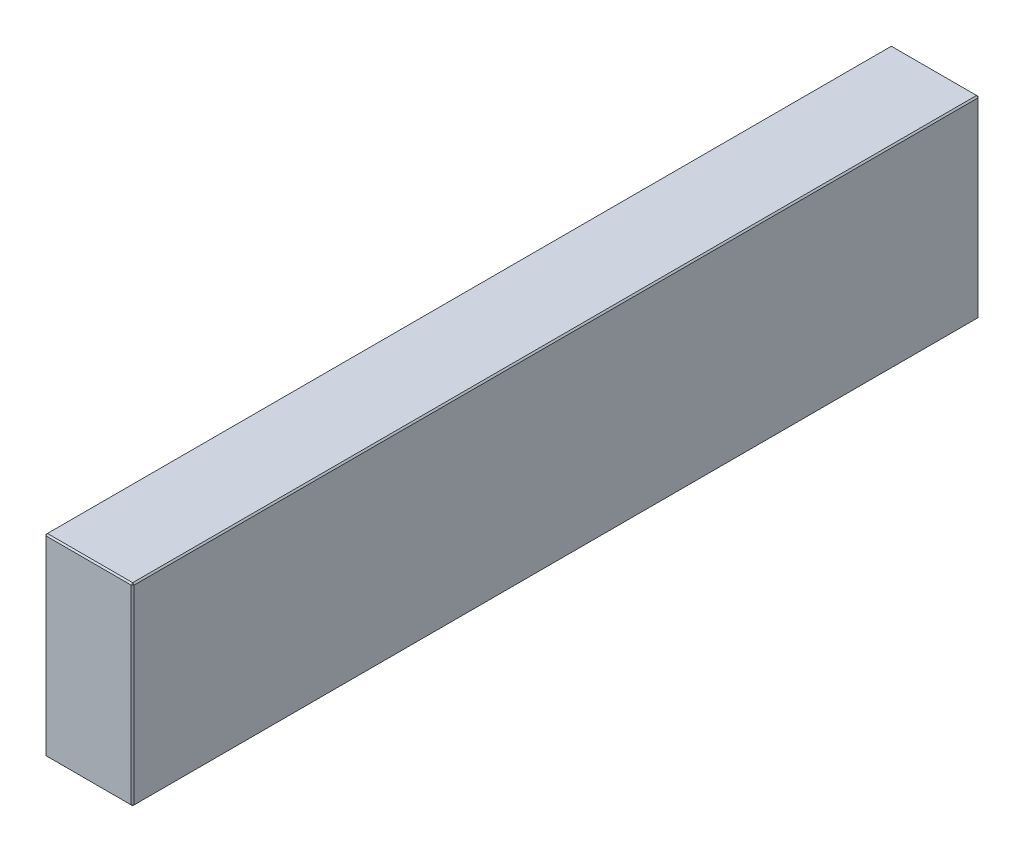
ISO-10303-21;
HEADER;
FILE_DESCRIPTION(('STEP AP214'),'2;1');
FILE_NAME('part.step','',(''),(''),'','','');
FILE_SCHEMA(('AUTOMOTIVE_DESIGN { 1 0 10303 214 1 1 1 1 }'));
ENDSEC;
DATA;
#1=APPLICATION_CONTEXT('core data for automotive mechanical design processes');
#2=APPLICATION_PROTOCOL_DEFINITION('international standard','automotive_design',2000,#1);
#3=PRODUCT_CONTEXT('',#1,'mechanical');
#4=PRODUCT('Part','Part','',(#3));
#5=PRODUCT_RELATED_PRODUCT_CATEGORY('part','',(#4));
#6=PRODUCT_DEFINITION_FORMATION('','',#4);
#7=PRODUCT_DEFINITION_CONTEXT('part definition',#1,'design');
#8=PRODUCT_DEFINITION('design','',#6,#7);
#9=PRODUCT_DEFINITION_SHAPE('','',#8);
#10=(LENGTH_UNIT() NAMED_UNIT(*) SI_UNIT(.MILLI.,.METRE.));
#11=(NAMED_UNIT(*) PLANE_ANGLE_UNIT() SI_UNIT($,.RADIAN.));
#12=(NAMED_UNIT(*) SI_UNIT($,.STERADIAN.) SOLID_ANGLE_UNIT());
#13=UNCERTAINTY_MEASURE_WITH_UNIT(LENGTH_MEASURE(1.E-05),#10,'distance_accuracy_value','');
#14=(GEOMETRIC_REPRESENTATION_CONTEXT(3) GLOBAL_UNCERTAINTY_ASSIGNED_CONTEXT((#13)) GLOBAL_UNIT_ASSIGNED_CONTEXT((#10,
#11,#12)) REPRESENTATION_CONTEXT('',''));
#15=CARTESIAN_POINT('',(0.,0.,0.));
#16=DIRECTION('',(0.,0.,1.));
#17=DIRECTION('',(1.,0.,0.));
#18=AXIS2_PLACEMENT_3D('',#15,#16,#17);
#19=CARTESIAN_POINT('',(-31.,136.,298.));
#20=DIRECTION('',(1.,0.,0.));
#21=DIRECTION('',(0.,0.,-1.));
#22=AXIS2_PLACEMENT_3D('',#19,#20,#21);
#23=PLANE('',#22);
#24=DIRECTION('',(0.,-1.,0.));
#25=VECTOR('',#24,1.);
#26=CARTESIAN_POINT('',(-31.,136.,-297.));
#27=LINE('',#26,#25);
#28=CARTESIAN_POINT('',(-31.,135.,-297.));
#29=VERTEX_POINT('',#28);
#30=CARTESIAN_POINT('',(-31.,0.999999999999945,-297.));
#31=VERTEX_POINT('',#30);
#32=EDGE_CURVE('E114',#29,#31,#27,.T.);
#33=ORIENTED_EDGE('',*,*,#32,.T.);
#34=DIRECTION('',(0.,0.,1.));
#35=VECTOR('',#34,1.);
#36=CARTESIAN_POINT('',(-31.,0.999999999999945,298.));
#37=LINE('',#36,#35);
#38=CARTESIAN_POINT('',(-31.,0.999999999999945,297.));
#39=VERTEX_POINT('',#38);
#40=EDGE_CURVE('E110',#31,#39,#37,.T.);
#41=ORIENTED_EDGE('',*,*,#40,.T.);
#42=DIRECTION('',(0.,1.,0.));
#43=VECTOR('',#42,1.);
#44=CARTESIAN_POINT('',(-31.,136.,297.));
#45=LINE('',#44,#43);
#46=CARTESIAN_POINT('',(-31.,135.,297.));
#47=VERTEX_POINT('',#46);
#48=EDGE_CURVE('E103',#39,#47,#45,.T.);
#49=ORIENTED_EDGE('',*,*,#48,.T.);
#50=DIRECTION('',(0.,0.,-1.));
#51=VECTOR('',#50,1.);
#52=CARTESIAN_POINT('',(-31.,135.,-298.));
#53=LINE('',#52,#51);
#54=EDGE_CURVE('E107',#47,#29,#53,.T.);
#55=ORIENTED_EDGE('',*,*,#54,.T.);
#56=EDGE_LOOP('',(#33,#41,#49,#55));
#57=FACE_BOUND('',#56,.T.);
#58=ADVANCED_FACE('F15',(#57),#23,.F.);
#59=CARTESIAN_POINT('',(31.,136.,298.));
#60=DIRECTION('',(0.,0.,-1.));
#61=DIRECTION('',(-1.,0.,0.));
#62=AXIS2_PLACEMENT_3D('',#59,#60,#61);
#63=PLANE('',#62);
#64=DIRECTION('',(-1.,0.,0.));
#65=VECTOR('',#64,1.);
#66=CARTESIAN_POINT('',(-31.,135.,298.));
#67=LINE('',#66,#65);
#68=CARTESIAN_POINT('',(30.,135.,298.));
#69=VERTEX_POINT('',#68);
#70=CARTESIAN_POINT('',(-30.,135.,298.));
#71=VERTEX_POINT('',#70);
#72=EDGE_CURVE('E164',#69,#71,#67,.T.);
#73=ORIENTED_EDGE('',*,*,#72,.T.);
#74=DIRECTION('',(0.,-1.,0.));
#75=VECTOR('',#74,1.);
#76=CARTESIAN_POINT('',(-30.,136.,298.));
#77=LINE('',#76,#75);
#78=CARTESIAN_POINT('',(-30.,0.999999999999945,298.));
#79=VERTEX_POINT('',#78);
#80=EDGE_CURVE('E122',#71,#79,#77,.T.);
#81=ORIENTED_EDGE('',*,*,#80,.T.);
#82=DIRECTION('',(1.,0.,0.));
#83=VECTOR('',#82,1.);
#84=CARTESIAN_POINT('',(31.,0.999999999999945,298.));
#85=LINE('',#84,#83);
#86=CARTESIAN_POINT('',(30.,0.999999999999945,298.));
#87=VERTEX_POINT('',#86);
#88=EDGE_CURVE('E168',#79,#87,#85,.T.);
#89=ORIENTED_EDGE('',*,*,#88,.T.);
#90=DIRECTION('',(0.,1.,0.));
#91=VECTOR('',#90,1.);
#92=CARTESIAN_POINT('',(30.,136.,298.));
#93=LINE('',#92,#91);
#94=EDGE_CURVE('E166',#87,#69,#93,.T.);
#95=ORIENTED_EDGE('',*,*,#94,.T.);
#96=EDGE_LOOP('',(#73,#81,#89,#95));
#97=FACE_BOUND('',#96,.T.);
#98=ADVANCED_FACE('F275',(#97),#63,.F.);
#99=CARTESIAN_POINT('',(31.,136.,298.));
#100=DIRECTION('',(-1.,0.,0.));
#101=DIRECTION('',(0.,0.,1.));
#102=AXIS2_PLACEMENT_3D('',#99,#100,#101);
#103=PLANE('',#102);
#104=DIRECTION('',(0.,0.,-1.));
#105=VECTOR('',#104,1.);
#106=CARTESIAN_POINT('',(31.,0.999999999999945,298.));
#107=LINE('',#106,#105);
#108=CARTESIAN_POINT('',(31.,0.999999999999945,297.));
#109=VERTEX_POINT('',#108);
#110=CARTESIAN_POINT('',(31.,0.999999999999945,-297.));
#111=VERTEX_POINT('',#110);
#112=EDGE_CURVE('E159',#109,#111,#107,.T.);
#113=ORIENTED_EDGE('',*,*,#112,.T.);
#114=DIRECTION('',(0.,1.,0.));
#115=VECTOR('',#114,1.);
#116=CARTESIAN_POINT('',(31.,136.,-297.));
#117=LINE('',#116,#115);
#118=CARTESIAN_POINT('',(31.,135.,-297.));
#119=VERTEX_POINT('',#118);
#120=EDGE_CURVE('E161',#111,#119,#117,.T.);
#121=ORIENTED_EDGE('',*,*,#120,.T.);
#122=DIRECTION('',(0.,0.,1.));
#123=VECTOR('',#122,1.);
#124=CARTESIAN_POINT('',(31.,135.,298.));
#125=LINE('',#124,#123);
#126=CARTESIAN_POINT('',(31.,135.,297.));
#127=VERTEX_POINT('',#126);
#128=EDGE_CURVE('E155',#119,#127,#125,.T.);
#129=ORIENTED_EDGE('',*,*,#128,.T.);
#130=DIRECTION('',(0.,-1.,0.));
#131=VECTOR('',#130,1.);
#132=CARTESIAN_POINT('',(31.,136.,297.));
#133=LINE('',#132,#131);
#134=EDGE_CURVE('E157',#127,#109,#133,.T.);
#135=ORIENTED_EDGE('',*,*,#134,.T.);
#136=EDGE_LOOP('',(#113,#121,#129,#135));
#137=FACE_BOUND('',#136,.T.);
#138=ADVANCED_FACE('F254',(#137),#103,.F.);
#139=CARTESIAN_POINT('',(31.,136.,-298.));
#140=DIRECTION('',(0.,0.,1.));
#141=DIRECTION('',(1.,0.,0.));
#142=AXIS2_PLACEMENT_3D('',#139,#140,#141);
#143=PLANE('',#142);
#144=DIRECTION('',(0.,-1.,0.));
#145=VECTOR('',#144,1.);
#146=CARTESIAN_POINT('',(30.,136.,-298.));
#147=LINE('',#146,#145);
#148=CARTESIAN_POINT('',(30.,135.,-298.));
#149=VERTEX_POINT('',#148);
#150=CARTESIAN_POINT('',(30.,0.999999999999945,-298.));
#151=VERTEX_POINT('',#150);
#152=EDGE_CURVE('E148',#149,#151,#147,.T.);
#153=ORIENTED_EDGE('',*,*,#152,.T.);
#154=DIRECTION('',(-1.,0.,0.));
#155=VECTOR('',#154,1.);
#156=CARTESIAN_POINT('',(31.,0.999999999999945,-298.));
#157=LINE('',#156,#155);
#158=CARTESIAN_POINT('',(-30.,0.999999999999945,-298.));
#159=VERTEX_POINT('',#158);
#160=EDGE_CURVE('E153',#151,#159,#157,.T.);
#161=ORIENTED_EDGE('',*,*,#160,.T.);
#162=DIRECTION('',(0.,1.,0.));
#163=VECTOR('',#162,1.);
#164=CARTESIAN_POINT('',(-30.,136.,-298.));
#165=LINE('',#164,#163);
#166=CARTESIAN_POINT('',(-30.,135.,-298.));
#167=VERTEX_POINT('',#166);
#168=EDGE_CURVE('E150',#159,#167,#165,.T.);
#169=ORIENTED_EDGE('',*,*,#168,.T.);
#170=DIRECTION('',(1.,0.,0.));
#171=VECTOR('',#170,1.);
#172=CARTESIAN_POINT('',(31.,135.,-298.));
#173=LINE('',#172,#171);
#174=EDGE_CURVE('E146',#167,#149,#173,.T.);
#175=ORIENTED_EDGE('',*,*,#174,.T.);
#176=EDGE_LOOP('',(#153,#161,#169,#175));
#177=FACE_BOUND('',#176,.T.);
#178=ADVANCED_FACE('F284',(#177),#143,.F.);
#179=CARTESIAN_POINT('',(0.,136.,0.));
#180=DIRECTION('',(0.,1.,0.));
#181=DIRECTION('',(0.,0.,1.));
#182=AXIS2_PLACEMENT_3D('',#179,#180,#181);
#183=PLANE('',#182);
#184=DIRECTION('',(0.,0.,-1.));
#185=VECTOR('',#184,1.);
#186=CARTESIAN_POINT('',(30.,136.,-298.));
#187=LINE('',#186,#185);
#188=CARTESIAN_POINT('',(30.,136.,297.));
#189=VERTEX_POINT('',#188);
#190=CARTESIAN_POINT('',(30.,136.,-297.));
#191=VERTEX_POINT('',#190);
#192=EDGE_CURVE('E24',#189,#191,#187,.T.);
#193=ORIENTED_EDGE('',*,*,#192,.T.);
#194=DIRECTION('',(-1.,0.,0.));
#195=VECTOR('',#194,1.);
#196=CARTESIAN_POINT('',(-31.,136.,-297.));
#197=LINE('',#196,#195);
#198=CARTESIAN_POINT('',(-30.,136.,-297.));
#199=VERTEX_POINT('',#198);
#200=EDGE_CURVE('E9',#191,#199,#197,.T.);
#201=ORIENTED_EDGE('',*,*,#200,.T.);
#202=DIRECTION('',(0.,0.,1.));
#203=VECTOR('',#202,1.);
#204=CARTESIAN_POINT('',(-30.,136.,298.));
#205=LINE('',#204,#203);
#206=CARTESIAN_POINT('',(-30.,136.,297.));
#207=VERTEX_POINT('',#206);
#208=EDGE_CURVE('E180',#199,#207,#205,.T.);
#209=ORIENTED_EDGE('',*,*,#208,.T.);
#210=DIRECTION('',(1.,0.,0.));
#211=VECTOR('',#210,1.);
#212=CARTESIAN_POINT('',(31.,136.,297.));
#213=LINE('',#212,#211);
#214=EDGE_CURVE('E35',#207,#189,#213,.T.);
#215=ORIENTED_EDGE('',*,*,#214,.T.);
#216=EDGE_LOOP('',(#193,#201,#209,#215));
#217=FACE_BOUND('',#216,.T.);
#218=ADVANCED_FACE('F350',(#217),#183,.T.);
#219=CARTESIAN_POINT('',(0.,0.,0.));
#220=DIRECTION('',(0.,1.,0.));
#221=DIRECTION('',(0.,0.,1.));
#222=AXIS2_PLACEMENT_3D('',#219,#220,#221);
#223=PLANE('',#222);
#224=DIRECTION('',(0.,0.,1.));
#225=VECTOR('',#224,1.);
#226=CARTESIAN_POINT('',(30.,0.,0.));
#227=LINE('',#226,#225);
#228=CARTESIAN_POINT('',(30.,0.,-297.));
#229=VERTEX_POINT('',#228);
#230=CARTESIAN_POINT('',(30.,0.,297.));
#231=VERTEX_POINT('',#230);
#232=EDGE_CURVE('E171',#229,#231,#227,.T.);
#233=ORIENTED_EDGE('',*,*,#232,.T.);
#234=DIRECTION('',(-1.,0.,0.));
#235=VECTOR('',#234,1.);
#236=CARTESIAN_POINT('',(0.,0.,297.));
#237=LINE('',#236,#235);
#238=CARTESIAN_POINT('',(-30.,0.,297.));
#239=VERTEX_POINT('',#238);
#240=EDGE_CURVE('E177',#231,#239,#237,.T.);
#241=ORIENTED_EDGE('',*,*,#240,.T.);
#242=DIRECTION('',(0.,0.,-1.));
#243=VECTOR('',#242,1.);
#244=CARTESIAN_POINT('',(-30.,0.,0.));
#245=LINE('',#244,#243);
#246=CARTESIAN_POINT('',(-30.,0.,-297.));
#247=VERTEX_POINT('',#246);
#248=EDGE_CURVE('E175',#239,#247,#245,.T.);
#249=ORIENTED_EDGE('',*,*,#248,.T.);
#250=DIRECTION('',(1.,0.,0.));
#251=VECTOR('',#250,1.);
#252=CARTESIAN_POINT('',(0.,0.,-297.));
#253=LINE('',#252,#251);
#254=EDGE_CURVE('E173',#247,#229,#253,.T.);
#255=ORIENTED_EDGE('',*,*,#254,.T.);
#256=EDGE_LOOP('',(#233,#241,#249,#255));
#257=FACE_BOUND('',#256,.T.);
#258=ADVANCED_FACE('F246',(#257),#223,.F.);
#259=CARTESIAN_POINT('',(31.,136.,297.));
#260=DIRECTION('',(-0.707106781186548,0.,-0.707106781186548));
#261=DIRECTION('',(0.,-1.,0.));
#262=AXIS2_PLACEMENT_3D('',#259,#260,#261);
#263=PLANE('',#262);
#264=DIRECTION('',(-0.707106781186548,0.,0.707106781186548));
#265=VECTOR('',#264,1.);
#266=CARTESIAN_POINT('',(30.,135.,298.));
#267=LINE('',#266,#265);
#268=EDGE_CURVE('E19',#69,#127,#267,.F.);
#269=ORIENTED_EDGE('',*,*,#268,.F.);
#270=ORIENTED_EDGE('',*,*,#94,.F.);
#271=DIRECTION('',(0.707106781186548,0.,-0.707106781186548));
#272=VECTOR('',#271,1.);
#273=CARTESIAN_POINT('',(30.,0.999999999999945,298.));
#274=LINE('',#273,#272);
#275=EDGE_CURVE('E142',#109,#87,#274,.F.);
#276=ORIENTED_EDGE('',*,*,#275,.F.);
#277=ORIENTED_EDGE('',*,*,#134,.F.);
#278=EDGE_LOOP('',(#269,#270,#276,#277));
#279=FACE_BOUND('',#278,.T.);
#280=ADVANCED_FACE('F17',(#279),#263,.F.);
#281=CARTESIAN_POINT('',(30.,135.,298.));
#282=DIRECTION('',(0.577350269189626,0.577350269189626,0.577350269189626));
#283=DIRECTION('',(0.707106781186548,0.,-0.707106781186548));
#284=AXIS2_PLACEMENT_3D('',#281,#282,#283);
#285=PLANE('',#284);
#286=DIRECTION('',(0.,-0.707106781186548,0.707106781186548));
#287=VECTOR('',#286,1.);
#288=CARTESIAN_POINT('',(30.,135.,298.));
#289=LINE('',#288,#287);
#290=EDGE_CURVE('E226',#69,#189,#289,.F.);
#291=ORIENTED_EDGE('',*,*,#290,.F.);
#292=ORIENTED_EDGE('',*,*,#268,.T.);
#293=DIRECTION('',(-0.707106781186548,0.707106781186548,0.));
#294=VECTOR('',#293,1.);
#295=CARTESIAN_POINT('',(30.5,135.5,297.));
#296=LINE('',#295,#294);
#297=EDGE_CURVE('E228',#189,#127,#296,.F.);
#298=ORIENTED_EDGE('',*,*,#297,.F.);
#299=EDGE_LOOP('',(#291,#292,#298));
#300=FACE_BOUND('',#299,.T.);
#301=ADVANCED_FACE('F270',(#300),#285,.T.);
#302=CARTESIAN_POINT('',(30.,0.999999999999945,298.));
#303=DIRECTION('',(0.577350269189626,-0.577350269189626,0.577350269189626));
#304=DIRECTION('',(0.707106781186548,0.,-0.707106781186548));
#305=AXIS2_PLACEMENT_3D('',#302,#303,#304);
#306=PLANE('',#305);
#307=DIRECTION('',(-0.707106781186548,-0.707106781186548,0.));
#308=VECTOR('',#307,1.);
#309=CARTESIAN_POINT('',(30.5,0.499999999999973,297.));
#310=LINE('',#309,#308);
#311=EDGE_CURVE('E220',#109,#231,#310,.T.);
#312=ORIENTED_EDGE('',*,*,#311,.F.);
#313=ORIENTED_EDGE('',*,*,#275,.T.);
#314=DIRECTION('',(0.,0.707106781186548,0.707106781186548));
#315=VECTOR('',#314,1.);
#316=CARTESIAN_POINT('',(30.,0.999999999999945,298.));
#317=LINE('',#316,#315);
#318=EDGE_CURVE('E223',#231,#87,#317,.T.);
#319=ORIENTED_EDGE('',*,*,#318,.F.);
#320=EDGE_LOOP('',(#312,#313,#319));
#321=FACE_BOUND('',#320,.T.);
#322=ADVANCED_FACE('F235',(#321),#306,.T.);
#323=CARTESIAN_POINT('',(30.,136.,0.));
#324=DIRECTION('',(0.707106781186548,0.707106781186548,0.));
#325=DIRECTION('',(0.,0.,1.));
#326=AXIS2_PLACEMENT_3D('',#323,#324,#325);
#327=PLANE('',#326);
#328=ORIENTED_EDGE('',*,*,#297,.T.);
#329=ORIENTED_EDGE('',*,*,#128,.F.);
#330=DIRECTION('',(0.707106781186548,-0.707106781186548,0.));
#331=VECTOR('',#330,1.);
#332=CARTESIAN_POINT('',(31.,135.,-297.));
#333=LINE('',#332,#331);
#334=EDGE_CURVE('E215',#191,#119,#333,.T.);
#335=ORIENTED_EDGE('',*,*,#334,.F.);
#336=ORIENTED_EDGE('',*,*,#192,.F.);
#337=EDGE_LOOP('',(#328,#329,#335,#336));
#338=FACE_BOUND('',#337,.T.);
#339=ADVANCED_FACE('F265',(#338),#327,.T.);
#340=CARTESIAN_POINT('',(0.,136.,297.));
#341=DIRECTION('',(0.,0.707106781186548,0.707106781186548));
#342=DIRECTION('',(-1.,0.,0.));
#343=AXIS2_PLACEMENT_3D('',#340,#341,#342);
#344=PLANE('',#343);
#345=ORIENTED_EDGE('',*,*,#290,.T.);
#346=ORIENTED_EDGE('',*,*,#214,.F.);
#347=DIRECTION('',(0.,0.707106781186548,-0.707106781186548));
#348=VECTOR('',#347,1.);
#349=CARTESIAN_POINT('',(-30.,135.5,297.5));
#350=LINE('',#349,#348);
#351=EDGE_CURVE('E126',#71,#207,#350,.T.);
#352=ORIENTED_EDGE('',*,*,#351,.F.);
#353=ORIENTED_EDGE('',*,*,#72,.F.);
#354=EDGE_LOOP('',(#345,#346,#352,#353));
#355=FACE_BOUND('',#354,.T.);
#356=ADVANCED_FACE('F273',(#355),#344,.T.);
#357=CARTESIAN_POINT('',(-30.,136.,298.));
#358=DIRECTION('',(0.707106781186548,0.,-0.707106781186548));
#359=DIRECTION('',(0.,-1.,0.));
#360=AXIS2_PLACEMENT_3D('',#357,#358,#359);
#361=PLANE('',#360);
#362=DIRECTION('',(0.707106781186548,0.,0.707106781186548));
#363=VECTOR('',#362,1.);
#364=CARTESIAN_POINT('',(-30.,0.999999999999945,298.));
#365=LINE('',#364,#363);
#366=EDGE_CURVE('E127',#79,#39,#365,.F.);
#367=ORIENTED_EDGE('',*,*,#366,.F.);
#368=ORIENTED_EDGE('',*,*,#80,.F.);
#369=DIRECTION('',(-0.707106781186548,0.,-0.707106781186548));
#370=VECTOR('',#369,1.);
#371=CARTESIAN_POINT('',(-31.,135.,297.));
#372=LINE('',#371,#370);
#373=EDGE_CURVE('E118',#47,#71,#372,.F.);
#374=ORIENTED_EDGE('',*,*,#373,.F.);
#375=ORIENTED_EDGE('',*,*,#48,.F.);
#376=EDGE_LOOP('',(#367,#368,#374,#375));
#377=FACE_BOUND('',#376,.T.);
#378=ADVANCED_FACE('F120',(#377),#361,.F.);
#379=CARTESIAN_POINT('',(31.,0.999999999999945,298.));
#380=DIRECTION('',(0.,0.707106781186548,-0.707106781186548));
#381=DIRECTION('',(1.,0.,0.));
#382=AXIS2_PLACEMENT_3D('',#379,#380,#381);
#383=PLANE('',#382);
#384=ORIENTED_EDGE('',*,*,#318,.T.);
#385=ORIENTED_EDGE('',*,*,#88,.F.);
#386=DIRECTION('',(0.,-0.707106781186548,-0.707106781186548));
#387=VECTOR('',#386,1.);
#388=CARTESIAN_POINT('',(-30.,0.999999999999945,298.));
#389=LINE('',#388,#387);
#390=EDGE_CURVE('E211',#239,#79,#389,.F.);
#391=ORIENTED_EDGE('',*,*,#390,.F.);
#392=ORIENTED_EDGE('',*,*,#240,.F.);
#393=EDGE_LOOP('',(#384,#385,#391,#392));
#394=FACE_BOUND('',#393,.T.);
#395=ADVANCED_FACE('F243',(#394),#383,.F.);
#396=CARTESIAN_POINT('',(31.,0.999999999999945,298.));
#397=DIRECTION('',(-0.707106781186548,0.707106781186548,0.));
#398=DIRECTION('',(0.,0.,-1.));
#399=AXIS2_PLACEMENT_3D('',#396,#397,#398);
#400=PLANE('',#399);
#401=ORIENTED_EDGE('',*,*,#311,.T.);
#402=ORIENTED_EDGE('',*,*,#232,.F.);
#403=DIRECTION('',(0.707106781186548,0.707106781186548,0.));
#404=VECTOR('',#403,1.);
#405=CARTESIAN_POINT('',(30.5,0.499999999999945,-297.));
#406=LINE('',#405,#404);
#407=EDGE_CURVE('E208',#111,#229,#406,.F.);
#408=ORIENTED_EDGE('',*,*,#407,.F.);
#409=ORIENTED_EDGE('',*,*,#112,.F.);
#410=EDGE_LOOP('',(#401,#402,#408,#409));
#411=FACE_BOUND('',#410,.T.);
#412=ADVANCED_FACE('F251',(#411),#400,.F.);
#413=CARTESIAN_POINT('',(30.,136.,-298.));
#414=DIRECTION('',(-0.707106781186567,0.,0.707106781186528));
#415=DIRECTION('',(0.,-1.,0.));
#416=AXIS2_PLACEMENT_3D('',#413,#414,#415);
#417=PLANE('',#416);
#418=DIRECTION('',(0.707106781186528,0.,0.707106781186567));
#419=VECTOR('',#418,1.);
#420=CARTESIAN_POINT('',(31.,135.,-297.));
#421=LINE('',#420,#419);
#422=EDGE_CURVE('E217',#119,#149,#421,.F.);
#423=ORIENTED_EDGE('',*,*,#422,.F.);
#424=ORIENTED_EDGE('',*,*,#120,.F.);
#425=DIRECTION('',(-0.707106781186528,0.,-0.707106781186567));
#426=VECTOR('',#425,1.);
#427=CARTESIAN_POINT('',(30.,0.999999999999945,-298.));
#428=LINE('',#427,#426);
#429=EDGE_CURVE('E205',#151,#111,#428,.F.);
#430=ORIENTED_EDGE('',*,*,#429,.F.);
#431=ORIENTED_EDGE('',*,*,#152,.F.);
#432=EDGE_LOOP('',(#423,#424,#430,#431));
#433=FACE_BOUND('',#432,.T.);
#434=ADVANCED_FACE('F258',(#433),#417,.F.);
#435=CARTESIAN_POINT('',(31.,135.,-297.));
#436=DIRECTION('',(0.577350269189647,0.577350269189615,-0.577350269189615));
#437=DIRECTION('',(-0.707106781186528,0.,-0.707106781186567));
#438=AXIS2_PLACEMENT_3D('',#435,#436,#437);
#439=PLANE('',#438);
#440=ORIENTED_EDGE('',*,*,#334,.T.);
#441=ORIENTED_EDGE('',*,*,#422,.T.);
#442=DIRECTION('',(0.,0.707106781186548,0.707106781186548));
#443=VECTOR('',#442,1.);
#444=CARTESIAN_POINT('',(30.,135.5,-297.5));
#445=LINE('',#444,#443);
#446=EDGE_CURVE('E134',#191,#149,#445,.F.);
#447=ORIENTED_EDGE('',*,*,#446,.F.);
#448=EDGE_LOOP('',(#440,#441,#447));
#449=FACE_BOUND('',#448,.T.);
#450=ADVANCED_FACE('F325',(#449),#439,.T.);
#451=CARTESIAN_POINT('',(-31.,135.,297.));
#452=DIRECTION('',(-0.577350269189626,0.577350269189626,0.577350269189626));
#453=DIRECTION('',(0.707106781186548,0.,0.707106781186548));
#454=AXIS2_PLACEMENT_3D('',#451,#452,#453);
#455=PLANE('',#454);
#456=ORIENTED_EDGE('',*,*,#373,.T.);
#457=ORIENTED_EDGE('',*,*,#351,.T.);
#458=DIRECTION('',(-0.707106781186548,-0.707106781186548,0.));
#459=VECTOR('',#458,1.);
#460=CARTESIAN_POINT('',(-31.,135.,297.));
#461=LINE('',#460,#459);
#462=EDGE_CURVE('E130',#47,#207,#461,.F.);
#463=ORIENTED_EDGE('',*,*,#462,.F.);
#464=EDGE_LOOP('',(#456,#457,#463));
#465=FACE_BOUND('',#464,.T.);
#466=ADVANCED_FACE('F131',(#465),#455,.T.);
#467=CARTESIAN_POINT('',(-30.,0.999999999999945,298.));
#468=DIRECTION('',(-0.577350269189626,-0.577350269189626,0.577350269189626));
#469=DIRECTION('',(0.707106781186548,0.,0.707106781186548));
#470=AXIS2_PLACEMENT_3D('',#467,#468,#469);
#471=PLANE('',#470);
#472=ORIENTED_EDGE('',*,*,#390,.T.);
#473=ORIENTED_EDGE('',*,*,#366,.T.);
#474=DIRECTION('',(-0.707106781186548,0.707106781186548,0.));
#475=VECTOR('',#474,1.);
#476=CARTESIAN_POINT('',(-30.5,0.499999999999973,297.));
#477=LINE('',#476,#475);
#478=EDGE_CURVE('E135',#239,#39,#477,.T.);
#479=ORIENTED_EDGE('',*,*,#478,.F.);
#480=EDGE_LOOP('',(#472,#473,#479));
#481=FACE_BOUND('',#480,.T.);
#482=ADVANCED_FACE('F318',(#481),#471,.T.);
#483=CARTESIAN_POINT('',(30.,0.999999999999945,-298.));
#484=DIRECTION('',(0.577350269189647,-0.577350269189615,-0.577350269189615));
#485=DIRECTION('',(-0.707106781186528,0.,-0.707106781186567));
#486=AXIS2_PLACEMENT_3D('',#483,#484,#485);
#487=PLANE('',#486);
#488=ORIENTED_EDGE('',*,*,#429,.T.);
#489=ORIENTED_EDGE('',*,*,#407,.T.);
#490=DIRECTION('',(0.,-0.707106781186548,0.707106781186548));
#491=VECTOR('',#490,1.);
#492=CARTESIAN_POINT('',(30.,0.999999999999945,-298.));
#493=LINE('',#492,#491);
#494=EDGE_CURVE('E198',#151,#229,#493,.T.);
#495=ORIENTED_EDGE('',*,*,#494,.F.);
#496=EDGE_LOOP('',(#488,#489,#495));
#497=FACE_BOUND('',#496,.T.);
#498=ADVANCED_FACE('F314',(#497),#487,.T.);
#499=CARTESIAN_POINT('',(0.,136.,-297.));
#500=DIRECTION('',(0.,0.707106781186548,-0.707106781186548));
#501=DIRECTION('',(1.,0.,0.));
#502=AXIS2_PLACEMENT_3D('',#499,#500,#501);
#503=PLANE('',#502);
#504=ORIENTED_EDGE('',*,*,#446,.T.);
#505=ORIENTED_EDGE('',*,*,#174,.F.);
#506=DIRECTION('',(0.,-0.707106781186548,-0.707106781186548));
#507=VECTOR('',#506,1.);
#508=CARTESIAN_POINT('',(-30.,135.,-298.));
#509=LINE('',#508,#507);
#510=EDGE_CURVE('E195',#199,#167,#509,.T.);
#511=ORIENTED_EDGE('',*,*,#510,.F.);
#512=ORIENTED_EDGE('',*,*,#200,.F.);
#513=EDGE_LOOP('',(#504,#505,#511,#512));
#514=FACE_BOUND('',#513,.T.);
#515=ADVANCED_FACE('F311',(#514),#503,.T.);
#516=CARTESIAN_POINT('',(-30.,136.,0.));
#517=DIRECTION('',(-0.707106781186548,0.707106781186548,0.));
#518=DIRECTION('',(0.,0.,-1.));
#519=AXIS2_PLACEMENT_3D('',#516,#517,#518);
#520=PLANE('',#519);
#521=ORIENTED_EDGE('',*,*,#462,.T.);
#522=ORIENTED_EDGE('',*,*,#208,.F.);
#523=DIRECTION('',(0.707106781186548,0.707106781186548,0.));
#524=VECTOR('',#523,1.);
#525=CARTESIAN_POINT('',(-30.5,135.5,-297.));
#526=LINE('',#525,#524);
#527=EDGE_CURVE('E138',#29,#199,#526,.T.);
#528=ORIENTED_EDGE('',*,*,#527,.F.);
#529=ORIENTED_EDGE('',*,*,#54,.F.);
#530=EDGE_LOOP('',(#521,#522,#528,#529));
#531=FACE_BOUND('',#530,.T.);
#532=ADVANCED_FACE('F137',(#531),#520,.T.);
#533=CARTESIAN_POINT('',(-31.,0.999999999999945,298.));
#534=DIRECTION('',(0.707106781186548,0.707106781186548,0.));
#535=DIRECTION('',(0.,0.,1.));
#536=AXIS2_PLACEMENT_3D('',#533,#534,#535);
#537=PLANE('',#536);
#538=ORIENTED_EDGE('',*,*,#478,.T.);
#539=ORIENTED_EDGE('',*,*,#40,.F.);
#540=DIRECTION('',(0.707106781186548,-0.707106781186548,0.));
#541=VECTOR('',#540,1.);
#542=CARTESIAN_POINT('',(-31.,0.999999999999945,-297.));
#543=LINE('',#542,#541);
#544=EDGE_CURVE('E191',#247,#31,#543,.F.);
#545=ORIENTED_EDGE('',*,*,#544,.F.);
#546=ORIENTED_EDGE('',*,*,#248,.F.);
#547=EDGE_LOOP('',(#538,#539,#545,#546));
#548=FACE_BOUND('',#547,.T.);
#549=ADVANCED_FACE('F304',(#548),#537,.F.);
#550=CARTESIAN_POINT('',(31.,0.999999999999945,-298.));
#551=DIRECTION('',(0.,0.707106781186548,0.707106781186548));
#552=DIRECTION('',(-1.,0.,0.));
#553=AXIS2_PLACEMENT_3D('',#550,#551,#552);
#554=PLANE('',#553);
#555=ORIENTED_EDGE('',*,*,#494,.T.);
#556=ORIENTED_EDGE('',*,*,#254,.F.);
#557=DIRECTION('',(0.,0.707106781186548,-0.707106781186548));
#558=VECTOR('',#557,1.);
#559=CARTESIAN_POINT('',(-30.,0.499999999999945,-297.5));
#560=LINE('',#559,#558);
#561=EDGE_CURVE('E188',#159,#247,#560,.F.);
#562=ORIENTED_EDGE('',*,*,#561,.F.);
#563=ORIENTED_EDGE('',*,*,#160,.F.);
#564=EDGE_LOOP('',(#555,#556,#562,#563));
#565=FACE_BOUND('',#564,.T.);
#566=ADVANCED_FACE('F300',(#565),#554,.F.);
#567=CARTESIAN_POINT('',(-30.,135.,-298.));
#568=DIRECTION('',(-0.577350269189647,0.577350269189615,-0.577350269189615));
#569=DIRECTION('',(-0.707106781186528,0.,0.707106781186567));
#570=AXIS2_PLACEMENT_3D('',#567,#568,#569);
#571=PLANE('',#570);
#572=ORIENTED_EDGE('',*,*,#527,.T.);
#573=ORIENTED_EDGE('',*,*,#510,.T.);
#574=DIRECTION('',(0.707106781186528,0.,-0.707106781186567));
#575=VECTOR('',#574,1.);
#576=CARTESIAN_POINT('',(-30.,135.,-298.));
#577=LINE('',#576,#575);
#578=EDGE_CURVE('E186',#29,#167,#577,.T.);
#579=ORIENTED_EDGE('',*,*,#578,.F.);
#580=EDGE_LOOP('',(#572,#573,#579));
#581=FACE_BOUND('',#580,.T.);
#582=ADVANCED_FACE('F296',(#581),#571,.T.);
#583=CARTESIAN_POINT('',(-31.,0.999999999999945,-297.));
#584=DIRECTION('',(-0.577350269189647,-0.577350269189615,-0.577350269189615));
#585=DIRECTION('',(-0.707106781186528,0.,0.707106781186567));
#586=AXIS2_PLACEMENT_3D('',#583,#584,#585);
#587=PLANE('',#586);
#588=ORIENTED_EDGE('',*,*,#561,.T.);
#589=ORIENTED_EDGE('',*,*,#544,.T.);
#590=DIRECTION('',(-0.707106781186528,0.,0.707106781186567));
#591=VECTOR('',#590,1.);
#592=CARTESIAN_POINT('',(-31.,0.999999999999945,-297.));
#593=LINE('',#592,#591);
#594=EDGE_CURVE('E184',#159,#31,#593,.T.);
#595=ORIENTED_EDGE('',*,*,#594,.F.);
#596=EDGE_LOOP('',(#588,#589,#595));
#597=FACE_BOUND('',#596,.T.);
#598=ADVANCED_FACE('F292',(#597),#587,.T.);
#599=CARTESIAN_POINT('',(-31.,136.,-297.));
#600=DIRECTION('',(0.707106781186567,0.,0.707106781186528));
#601=DIRECTION('',(0.,-1.,0.));
#602=AXIS2_PLACEMENT_3D('',#599,#600,#601);
#603=PLANE('',#602);
#604=ORIENTED_EDGE('',*,*,#578,.T.);
#605=ORIENTED_EDGE('',*,*,#168,.F.);
#606=ORIENTED_EDGE('',*,*,#594,.T.);
#607=ORIENTED_EDGE('',*,*,#32,.F.);
#608=EDGE_LOOP('',(#604,#605,#606,#607));
#609=FACE_BOUND('',#608,.T.);
#610=ADVANCED_FACE('F289',(#609),#603,.F.);
#611=CLOSED_SHELL('',(#58,#98,#138,#178,#218,#258,#280,#301,#322,#339,#356,#378,#395,#412,#434,
#450,#466,#482,#498,#515,#532,#549,#566,#582,#598,#610));
#612=MANIFOLD_SOLID_BREP('B1',#611);
#613=ADVANCED_BREP_SHAPE_REPRESENTATION('',(#18,#612),#14);
#614=SHAPE_DEFINITION_REPRESENTATION(#9,#613);
ENDSEC;
END-ISO-10303-21;
